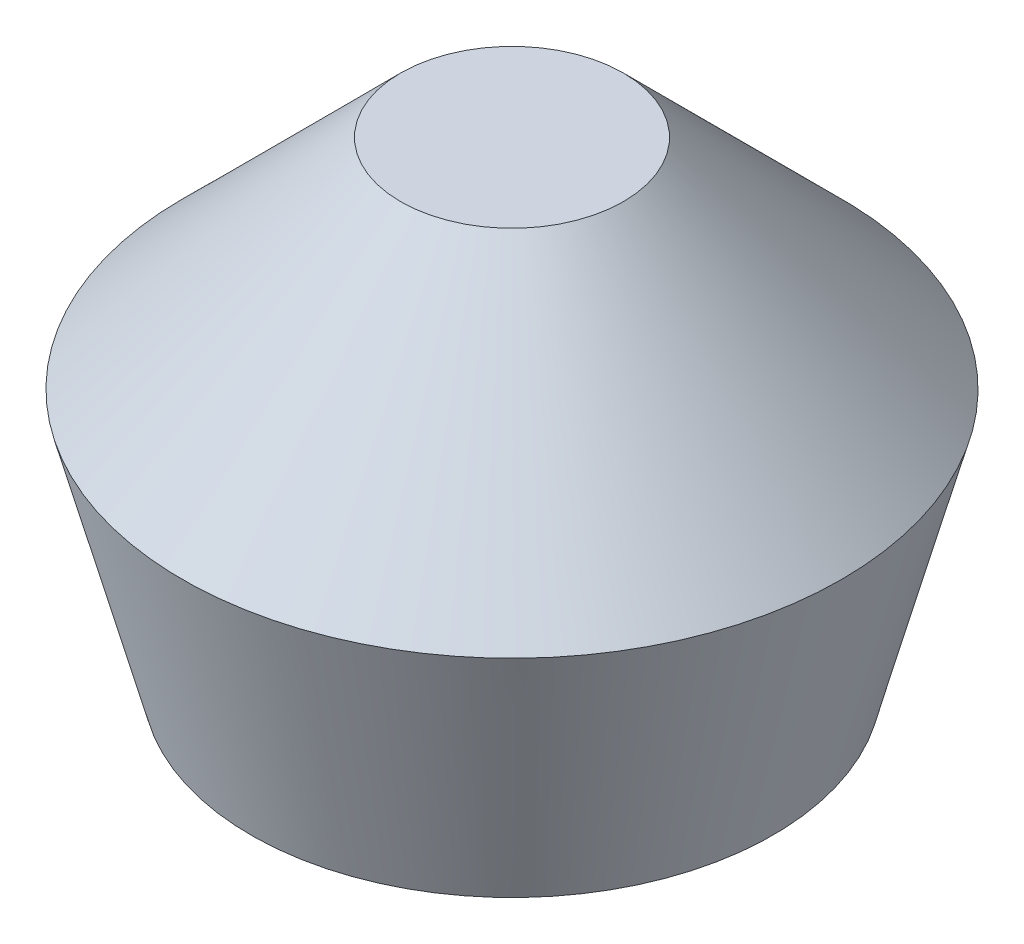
ISO-10303-21;
HEADER;
FILE_DESCRIPTION(('STEP AP214'),'2;1');
FILE_NAME('part.step','',(''),(''),'','','');
FILE_SCHEMA(('AUTOMOTIVE_DESIGN { 1 0 10303 214 1 1 1 1 }'));
ENDSEC;
DATA;
#1=APPLICATION_CONTEXT('core data for automotive mechanical design processes');
#2=APPLICATION_PROTOCOL_DEFINITION('international standard','automotive_design',2000,#1);
#3=PRODUCT_CONTEXT('',#1,'mechanical');
#4=PRODUCT('Part','Part','',(#3));
#5=PRODUCT_RELATED_PRODUCT_CATEGORY('part','',(#4));
#6=PRODUCT_DEFINITION_FORMATION('','',#4);
#7=PRODUCT_DEFINITION_CONTEXT('part definition',#1,'design');
#8=PRODUCT_DEFINITION('design','',#6,#7);
#9=PRODUCT_DEFINITION_SHAPE('','',#8);
#10=(LENGTH_UNIT() NAMED_UNIT(*) SI_UNIT(.MILLI.,.METRE.));
#11=(NAMED_UNIT(*) PLANE_ANGLE_UNIT() SI_UNIT($,.RADIAN.));
#12=(NAMED_UNIT(*) SI_UNIT($,.STERADIAN.) SOLID_ANGLE_UNIT());
#13=UNCERTAINTY_MEASURE_WITH_UNIT(LENGTH_MEASURE(1.E-05),#10,'distance_accuracy_value','');
#14=(GEOMETRIC_REPRESENTATION_CONTEXT(3) GLOBAL_UNCERTAINTY_ASSIGNED_CONTEXT((#13)) GLOBAL_UNIT_ASSIGNED_CONTEXT((#10,
#11,#12)) REPRESENTATION_CONTEXT('',''));
#15=CARTESIAN_POINT('',(0.,0.,0.));
#16=DIRECTION('',(0.,0.,1.));
#17=DIRECTION('',(1.,0.,0.));
#18=AXIS2_PLACEMENT_3D('',#15,#16,#17);
#19=CARTESIAN_POINT('',(0.,-4.27176599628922,21.4330454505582));
#20=DIRECTION('',(0.,-1.,0.));
#21=DIRECTION('',(0.,0.,-1.));
#22=AXIS2_PLACEMENT_3D('',#19,#20,#21);
#23=PLANE('',#22);
#24=CARTESIAN_POINT('',(0.,-4.2717659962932,23.8460454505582));
#25=DIRECTION('',(0.,-1.,0.));
#26=DIRECTION('',(1.,0.,0.));
#27=AXIS2_PLACEMENT_3D('',#24,#25,#26);
#28=CIRCLE('',#27,2.41299999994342);
#29=CARTESIAN_POINT('',(2.41299999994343,-4.2717659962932,23.8460454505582));
#30=VERTEX_POINT('',#29);
#31=EDGE_CURVE('E18',#30,#30,#28,.T.);
#32=ORIENTED_EDGE('',*,*,#31,.F.);
#33=EDGE_LOOP('',(#32));
#34=FACE_BOUND('',#33,.T.);
#35=ADVANCED_FACE('F15',(#34),#23,.F.);
#36=CARTESIAN_POINT('',(0.,-14.5333659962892,23.8460454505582));
#37=DIRECTION('',(0.,1.,0.));
#38=DIRECTION('',(0.,0.,1.));
#39=AXIS2_PLACEMENT_3D('',#36,#37,#38);
#40=PLANE('',#39);
#41=CARTESIAN_POINT('',(0.,-14.5333659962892,23.8460454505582));
#42=DIRECTION('',(0.,1.,0.));
#43=DIRECTION('',(-1.,0.,0.));
#44=AXIS2_PLACEMENT_3D('',#41,#42,#43);
#45=CIRCLE('',#44,5.65371173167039);
#46=CARTESIAN_POINT('',(-5.65371173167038,-14.5333659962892,23.8460454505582));
#47=VERTEX_POINT('',#46);
#48=EDGE_CURVE('E22',#47,#47,#45,.T.);
#49=ORIENTED_EDGE('',*,*,#48,.F.);
#50=EDGE_LOOP('',(#49));
#51=FACE_BOUND('',#50,.T.);
#52=ADVANCED_FACE('F38',(#51),#40,.F.);
#53=CARTESIAN_POINT('',(0.,-8.99616599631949,23.8460454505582));
#54=DIRECTION('',(0.,-1.,0.));
#55=DIRECTION('',(1.,0.,0.));
#56=AXIS2_PLACEMENT_3D('',#53,#54,#55);
#57=CONICAL_SURFACE('',#56,7.1373999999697,0.785398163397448);
#58=ORIENTED_EDGE('',*,*,#31,.T.);
#59=EDGE_LOOP('',(#58));
#60=FACE_BOUND('',#59,.T.);
#61=CARTESIAN_POINT('',(0.,-8.99616599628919,23.8460454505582));
#62=DIRECTION('',(0.,1.,0.));
#63=DIRECTION('',(-1.,0.,0.));
#64=AXIS2_PLACEMENT_3D('',#61,#62,#63);
#65=CIRCLE('',#64,7.1374);
#66=CARTESIAN_POINT('',(-7.13739999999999,-8.99616599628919,23.8460454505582));
#67=VERTEX_POINT('',#66);
#68=EDGE_CURVE('E10',#67,#67,#65,.F.);
#69=ORIENTED_EDGE('',*,*,#68,.F.);
#70=EDGE_LOOP('',(#69));
#71=FACE_BOUND('',#70,.T.);
#72=ADVANCED_FACE('F34',(#60,#71),#57,.T.);
#73=CARTESIAN_POINT('',(0.,-8.99616599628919,23.8460454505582));
#74=DIRECTION('',(0.,1.,0.));
#75=DIRECTION('',(-1.,0.,0.));
#76=AXIS2_PLACEMENT_3D('',#73,#74,#75);
#77=CONICAL_SURFACE('',#76,7.1374,0.26179938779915);
#78=ORIENTED_EDGE('',*,*,#68,.T.);
#79=EDGE_LOOP('',(#78));
#80=FACE_BOUND('',#79,.T.);
#81=ORIENTED_EDGE('',*,*,#48,.T.);
#82=EDGE_LOOP('',(#81));
#83=FACE_BOUND('',#82,.T.);
#84=ADVANCED_FACE('F44',(#80,#83),#77,.T.);
#85=CLOSED_SHELL('',(#35,#52,#72,#84));
#86=MANIFOLD_SOLID_BREP('B1',#85);
#87=ADVANCED_BREP_SHAPE_REPRESENTATION('',(#18,#86),#14);
#88=SHAPE_DEFINITION_REPRESENTATION(#9,#87);
ENDSEC;
END-ISO-10303-21;
